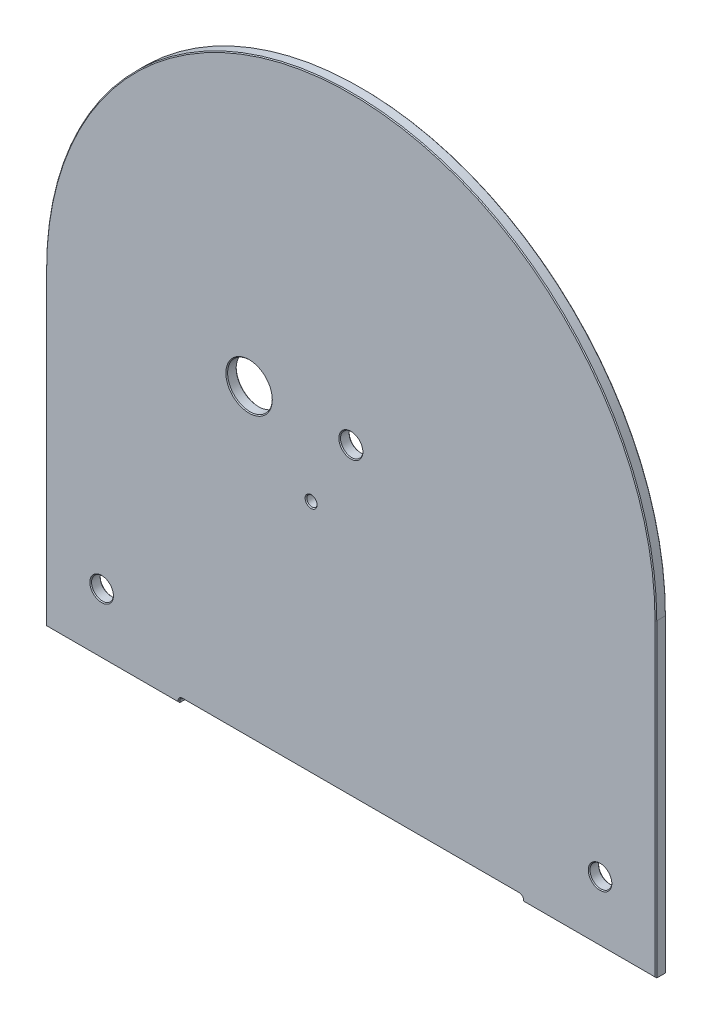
ISO-10303-21;
HEADER;
FILE_DESCRIPTION(('STEP AP214'),'2;1');
FILE_NAME('part.step','',(''),(''),'','','');
FILE_SCHEMA(('AUTOMOTIVE_DESIGN { 1 0 10303 214 1 1 1 1 }'));
ENDSEC;
DATA;
#1=APPLICATION_CONTEXT('core data for automotive mechanical design processes');
#2=APPLICATION_PROTOCOL_DEFINITION('international standard','automotive_design',2000,#1);
#3=PRODUCT_CONTEXT('',#1,'mechanical');
#4=PRODUCT('Part','Part','',(#3));
#5=PRODUCT_RELATED_PRODUCT_CATEGORY('part','',(#4));
#6=PRODUCT_DEFINITION_FORMATION('','',#4);
#7=PRODUCT_DEFINITION_CONTEXT('part definition',#1,'design');
#8=PRODUCT_DEFINITION('design','',#6,#7);
#9=PRODUCT_DEFINITION_SHAPE('','',#8);
#10=(LENGTH_UNIT() NAMED_UNIT(*) SI_UNIT(.MILLI.,.METRE.));
#11=(NAMED_UNIT(*) PLANE_ANGLE_UNIT() SI_UNIT($,.RADIAN.));
#12=(NAMED_UNIT(*) SI_UNIT($,.STERADIAN.) SOLID_ANGLE_UNIT());
#13=UNCERTAINTY_MEASURE_WITH_UNIT(LENGTH_MEASURE(1.E-05),#10,'distance_accuracy_value','');
#14=(GEOMETRIC_REPRESENTATION_CONTEXT(3) GLOBAL_UNCERTAINTY_ASSIGNED_CONTEXT((#13)) GLOBAL_UNIT_ASSIGNED_CONTEXT((#10,
#11,#12)) REPRESENTATION_CONTEXT('',''));
#15=CARTESIAN_POINT('',(0.,0.,0.));
#16=DIRECTION('',(0.,0.,1.));
#17=DIRECTION('',(1.,0.,0.));
#18=AXIS2_PLACEMENT_3D('',#15,#16,#17);
#19=CARTESIAN_POINT('',(-97.9999999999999,-177.73,6.));
#20=DIRECTION('',(0.,0.,1.));
#21=DIRECTION('',(1.,0.,0.));
#22=AXIS2_PLACEMENT_3D('',#19,#20,#21);
#23=PLANE('',#22);
#24=CARTESIAN_POINT('',(-59.2,1.27,6.));
#25=DIRECTION('',(0.,0.,1.));
#26=DIRECTION('',(1.,0.,0.));
#27=AXIS2_PLACEMENT_3D('',#24,#25,#26);
#28=CIRCLE('',#27,13.4999999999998);
#29=CARTESIAN_POINT('',(-45.7000000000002,1.27,6.));
#30=VERTEX_POINT('',#29);
#31=EDGE_CURVE('E11',#30,#30,#28,.F.);
#32=ORIENTED_EDGE('',*,*,#31,.T.);
#33=EDGE_LOOP('',(#32));
#34=FACE_BOUND('',#33,.T.);
#35=CARTESIAN_POINT('',(0.,1.27,6.));
#36=DIRECTION('',(0.,0.,1.));
#37=DIRECTION('',(1.,0.,0.));
#38=AXIS2_PLACEMENT_3D('',#35,#36,#37);
#39=CIRCLE('',#38,7.00000000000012);
#40=CARTESIAN_POINT('',(7.00000000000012,1.27,6.));
#41=VERTEX_POINT('',#40);
#42=EDGE_CURVE('E39',#41,#41,#39,.F.);
#43=ORIENTED_EDGE('',*,*,#42,.T.);
#44=EDGE_LOOP('',(#43));
#45=FACE_BOUND('',#44,.T.);
#46=CARTESIAN_POINT('',(-145.,-143.73,6.));
#47=DIRECTION('',(0.,0.,1.));
#48=DIRECTION('',(1.,0.,0.));
#49=AXIS2_PLACEMENT_3D('',#46,#47,#48);
#50=CIRCLE('',#49,6.84999999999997);
#51=CARTESIAN_POINT('',(-138.15,-143.73,6.));
#52=VERTEX_POINT('',#51);
#53=EDGE_CURVE('E305',#52,#52,#50,.F.);
#54=ORIENTED_EDGE('',*,*,#53,.T.);
#55=EDGE_LOOP('',(#54));
#56=FACE_BOUND('',#55,.T.);
#57=DIRECTION('',(1.,0.,0.));
#58=VECTOR('',#57,1.);
#59=CARTESIAN_POINT('',(-100.,-178.23,6.));
#60=LINE('',#59,#58);
#61=CARTESIAN_POINT('',(-177.,-178.23,6.));
#62=VERTEX_POINT('',#61);
#63=CARTESIAN_POINT('',(-100.5,-178.23,6.));
#64=VERTEX_POINT('',#63);
#65=EDGE_CURVE('E47',#62,#64,#60,.T.);
#66=ORIENTED_EDGE('',*,*,#65,.T.);
#67=DIRECTION('',(0.,1.,0.));
#68=VECTOR('',#67,1.);
#69=CARTESIAN_POINT('',(-100.5,-177.73,6.));
#70=LINE('',#69,#68);
#71=CARTESIAN_POINT('',(-100.5,-177.73,6.));
#72=VERTEX_POINT('',#71);
#73=EDGE_CURVE('E303',#64,#72,#70,.T.);
#74=ORIENTED_EDGE('',*,*,#73,.T.);
#75=CARTESIAN_POINT('',(-97.9999999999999,-177.73,6.));
#76=DIRECTION('',(0.,0.,1.));
#77=DIRECTION('',(1.,0.,0.));
#78=AXIS2_PLACEMENT_3D('',#75,#76,#77);
#79=CIRCLE('',#78,2.5);
#80=CARTESIAN_POINT('',(-97.9999999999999,-175.23,6.));
#81=VERTEX_POINT('',#80);
#82=EDGE_CURVE('E287',#72,#81,#79,.F.);
#83=ORIENTED_EDGE('',*,*,#82,.T.);
#84=DIRECTION('',(1.,0.,0.));
#85=VECTOR('',#84,1.);
#86=CARTESIAN_POINT('',(97.9999999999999,-175.23,6.));
#87=LINE('',#86,#85);
#88=CARTESIAN_POINT('',(97.9999999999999,-175.23,6.));
#89=VERTEX_POINT('',#88);
#90=EDGE_CURVE('E289',#81,#89,#87,.T.);
#91=ORIENTED_EDGE('',*,*,#90,.T.);
#92=CARTESIAN_POINT('',(97.9999999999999,-177.73,6.));
#93=DIRECTION('',(0.,0.,1.));
#94=DIRECTION('',(1.,0.,0.));
#95=AXIS2_PLACEMENT_3D('',#92,#93,#94);
#96=CIRCLE('',#95,2.50000000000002);
#97=CARTESIAN_POINT('',(100.5,-177.73,6.));
#98=VERTEX_POINT('',#97);
#99=EDGE_CURVE('E291',#89,#98,#96,.F.);
#100=ORIENTED_EDGE('',*,*,#99,.T.);
#101=DIRECTION('',(0.,-1.,0.));
#102=VECTOR('',#101,1.);
#103=CARTESIAN_POINT('',(100.5,-178.73,6.));
#104=LINE('',#103,#102);
#105=CARTESIAN_POINT('',(100.5,-178.23,6.));
#106=VERTEX_POINT('',#105);
#107=EDGE_CURVE('E293',#98,#106,#104,.T.);
#108=ORIENTED_EDGE('',*,*,#107,.T.);
#109=DIRECTION('',(1.,0.,0.));
#110=VECTOR('',#109,1.);
#111=CARTESIAN_POINT('',(177.5,-178.23,6.));
#112=LINE('',#111,#110);
#113=CARTESIAN_POINT('',(177.,-178.23,6.));
#114=VERTEX_POINT('',#113);
#115=EDGE_CURVE('E295',#106,#114,#112,.T.);
#116=ORIENTED_EDGE('',*,*,#115,.T.);
#117=DIRECTION('',(0.,1.,0.));
#118=VECTOR('',#117,1.);
#119=CARTESIAN_POINT('',(177.,1.27,6.));
#120=LINE('',#119,#118);
#121=CARTESIAN_POINT('',(177.,1.27,6.));
#122=VERTEX_POINT('',#121);
#123=EDGE_CURVE('E297',#114,#122,#120,.T.);
#124=ORIENTED_EDGE('',*,*,#123,.T.);
#125=CARTESIAN_POINT('',(0.,1.27,6.));
#126=DIRECTION('',(0.,0.,1.));
#127=DIRECTION('',(1.,0.,0.));
#128=AXIS2_PLACEMENT_3D('',#125,#126,#127);
#129=CIRCLE('',#128,177.);
#130=CARTESIAN_POINT('',(-177.,1.27000000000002,6.));
#131=VERTEX_POINT('',#130);
#132=EDGE_CURVE('E299',#122,#131,#129,.T.);
#133=ORIENTED_EDGE('',*,*,#132,.T.);
#134=DIRECTION('',(0.,-1.,0.));
#135=VECTOR('',#134,1.);
#136=CARTESIAN_POINT('',(-177.,-178.73,6.));
#137=LINE('',#136,#135);
#138=EDGE_CURVE('E52',#131,#62,#137,.T.);
#139=ORIENTED_EDGE('',*,*,#138,.T.);
#140=EDGE_LOOP('',(#66,#74,#83,#91,#100,#108,#116,#124,#133,#139));
#141=FACE_BOUND('',#140,.T.);
#142=CARTESIAN_POINT('',(145.,-143.73,6.));
#143=DIRECTION('',(0.,0.,1.));
#144=DIRECTION('',(1.,0.,0.));
#145=AXIS2_PLACEMENT_3D('',#142,#143,#144);
#146=CIRCLE('',#145,6.84999999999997);
#147=CARTESIAN_POINT('',(151.85,-143.73,6.));
#148=VERTEX_POINT('',#147);
#149=EDGE_CURVE('E284',#148,#148,#146,.F.);
#150=ORIENTED_EDGE('',*,*,#149,.T.);
#151=EDGE_LOOP('',(#150));
#152=FACE_BOUND('',#151,.T.);
#153=CARTESIAN_POINT('',(-23.12,-38.7288199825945,6.));
#154=DIRECTION('',(0.,0.,1.));
#155=DIRECTION('',(1.,0.,0.));
#156=AXIS2_PLACEMENT_3D('',#153,#154,#155);
#157=CIRCLE('',#156,3.5);
#158=CARTESIAN_POINT('',(-19.62,-38.7288199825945,6.));
#159=VERTEX_POINT('',#158);
#160=EDGE_CURVE('E281',#159,#159,#157,.F.);
#161=ORIENTED_EDGE('',*,*,#160,.T.);
#162=EDGE_LOOP('',(#161));
#163=FACE_BOUND('',#162,.T.);
#164=ADVANCED_FACE('F30',(#34,#45,#56,#141,#152,#163),#23,.T.);
#165=CARTESIAN_POINT('',(-97.9999999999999,-177.73,0.));
#166=DIRECTION('',(0.,0.,1.));
#167=DIRECTION('',(1.,0.,0.));
#168=AXIS2_PLACEMENT_3D('',#165,#166,#167);
#169=PLANE('',#168);
#170=CARTESIAN_POINT('',(-59.2,1.27,0.));
#171=DIRECTION('',(0.,0.,1.));
#172=DIRECTION('',(1.,0.,0.));
#173=AXIS2_PLACEMENT_3D('',#170,#171,#172);
#174=CIRCLE('',#173,13.5);
#175=CARTESIAN_POINT('',(-45.7,1.27,0.));
#176=VERTEX_POINT('',#175);
#177=EDGE_CURVE('E208',#176,#176,#174,.T.);
#178=ORIENTED_EDGE('',*,*,#177,.T.);
#179=EDGE_LOOP('',(#178));
#180=FACE_BOUND('',#179,.T.);
#181=CARTESIAN_POINT('',(0.,1.27,0.));
#182=DIRECTION('',(0.,0.,1.));
#183=DIRECTION('',(1.,0.,0.));
#184=AXIS2_PLACEMENT_3D('',#181,#182,#183);
#185=CIRCLE('',#184,6.9999999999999);
#186=CARTESIAN_POINT('',(6.9999999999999,1.27,0.));
#187=VERTEX_POINT('',#186);
#188=EDGE_CURVE('E200',#187,#187,#185,.T.);
#189=ORIENTED_EDGE('',*,*,#188,.T.);
#190=EDGE_LOOP('',(#189));
#191=FACE_BOUND('',#190,.T.);
#192=CARTESIAN_POINT('',(-145.,-143.73,0.));
#193=DIRECTION('',(0.,0.,1.));
#194=DIRECTION('',(1.,0.,0.));
#195=AXIS2_PLACEMENT_3D('',#192,#193,#194);
#196=CIRCLE('',#195,6.85000000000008);
#197=CARTESIAN_POINT('',(-138.15,-143.73,0.));
#198=VERTEX_POINT('',#197);
#199=EDGE_CURVE('E197',#198,#198,#196,.T.);
#200=ORIENTED_EDGE('',*,*,#199,.T.);
#201=EDGE_LOOP('',(#200));
#202=FACE_BOUND('',#201,.T.);
#203=CARTESIAN_POINT('',(97.9999999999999,-177.73,0.));
#204=DIRECTION('',(0.,0.,1.));
#205=DIRECTION('',(1.,0.,0.));
#206=AXIS2_PLACEMENT_3D('',#203,#204,#205);
#207=CIRCLE('',#206,2.49999999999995);
#208=CARTESIAN_POINT('',(100.5,-177.73,0.));
#209=VERTEX_POINT('',#208);
#210=CARTESIAN_POINT('',(97.9999999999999,-175.23,0.));
#211=VERTEX_POINT('',#210);
#212=EDGE_CURVE('E196',#209,#211,#207,.T.);
#213=ORIENTED_EDGE('',*,*,#212,.T.);
#214=DIRECTION('',(-1.,0.,0.));
#215=VECTOR('',#214,1.);
#216=CARTESIAN_POINT('',(-97.9999999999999,-175.23,0.));
#217=LINE('',#216,#215);
#218=CARTESIAN_POINT('',(-97.9999999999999,-175.23,0.));
#219=VERTEX_POINT('',#218);
#220=EDGE_CURVE('E174',#211,#219,#217,.T.);
#221=ORIENTED_EDGE('',*,*,#220,.T.);
#222=CARTESIAN_POINT('',(-97.9999999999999,-177.73,0.));
#223=DIRECTION('',(0.,0.,1.));
#224=DIRECTION('',(1.,0.,0.));
#225=AXIS2_PLACEMENT_3D('',#222,#223,#224);
#226=CIRCLE('',#225,2.49999999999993);
#227=CARTESIAN_POINT('',(-100.5,-177.73,0.));
#228=VERTEX_POINT('',#227);
#229=EDGE_CURVE('E184',#219,#228,#226,.T.);
#230=ORIENTED_EDGE('',*,*,#229,.T.);
#231=DIRECTION('',(0.,-1.,0.));
#232=VECTOR('',#231,1.);
#233=CARTESIAN_POINT('',(-100.5,-177.73,0.));
#234=LINE('',#233,#232);
#235=CARTESIAN_POINT('',(-100.5,-178.23,0.));
#236=VERTEX_POINT('',#235);
#237=EDGE_CURVE('E190',#228,#236,#234,.T.);
#238=ORIENTED_EDGE('',*,*,#237,.T.);
#239=DIRECTION('',(-1.,0.,0.));
#240=VECTOR('',#239,1.);
#241=CARTESIAN_POINT('',(-97.9999999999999,-178.23,0.));
#242=LINE('',#241,#240);
#243=CARTESIAN_POINT('',(-177.,-178.23,0.));
#244=VERTEX_POINT('',#243);
#245=EDGE_CURVE('E404',#236,#244,#242,.T.);
#246=ORIENTED_EDGE('',*,*,#245,.T.);
#247=DIRECTION('',(0.,1.,0.));
#248=VECTOR('',#247,1.);
#249=CARTESIAN_POINT('',(-177.,-177.73,0.));
#250=LINE('',#249,#248);
#251=CARTESIAN_POINT('',(-177.,1.27000000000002,0.));
#252=VERTEX_POINT('',#251);
#253=EDGE_CURVE('E406',#244,#252,#250,.T.);
#254=ORIENTED_EDGE('',*,*,#253,.T.);
#255=CARTESIAN_POINT('',(0.,1.27,0.));
#256=DIRECTION('',(0.,0.,1.));
#257=DIRECTION('',(1.,0.,0.));
#258=AXIS2_PLACEMENT_3D('',#255,#256,#257);
#259=CIRCLE('',#258,177.);
#260=CARTESIAN_POINT('',(177.,1.27,0.));
#261=VERTEX_POINT('',#260);
#262=EDGE_CURVE('E408',#252,#261,#259,.F.);
#263=ORIENTED_EDGE('',*,*,#262,.T.);
#264=DIRECTION('',(0.,-1.,0.));
#265=VECTOR('',#264,1.);
#266=CARTESIAN_POINT('',(177.,-177.73,0.));
#267=LINE('',#266,#265);
#268=CARTESIAN_POINT('',(177.,-178.23,0.));
#269=VERTEX_POINT('',#268);
#270=EDGE_CURVE('E410',#261,#269,#267,.T.);
#271=ORIENTED_EDGE('',*,*,#270,.T.);
#272=DIRECTION('',(-1.,0.,0.));
#273=VECTOR('',#272,1.);
#274=CARTESIAN_POINT('',(-97.9999999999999,-178.23,0.));
#275=LINE('',#274,#273);
#276=CARTESIAN_POINT('',(100.5,-178.23,0.));
#277=VERTEX_POINT('',#276);
#278=EDGE_CURVE('E412',#269,#277,#275,.T.);
#279=ORIENTED_EDGE('',*,*,#278,.T.);
#280=DIRECTION('',(0.,1.,0.));
#281=VECTOR('',#280,1.);
#282=CARTESIAN_POINT('',(100.5,-177.729999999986,0.));
#283=LINE('',#282,#281);
#284=EDGE_CURVE('E202',#277,#209,#283,.T.);
#285=ORIENTED_EDGE('',*,*,#284,.T.);
#286=EDGE_LOOP('',(#213,#221,#230,#238,#246,#254,#263,#271,#279,#285));
#287=FACE_BOUND('',#286,.T.);
#288=CARTESIAN_POINT('',(145.,-143.73,0.));
#289=DIRECTION('',(0.,0.,1.));
#290=DIRECTION('',(1.,0.,0.));
#291=AXIS2_PLACEMENT_3D('',#288,#289,#290);
#292=CIRCLE('',#291,6.85000000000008);
#293=CARTESIAN_POINT('',(151.85,-143.73,0.));
#294=VERTEX_POINT('',#293);
#295=EDGE_CURVE('E191',#294,#294,#292,.T.);
#296=ORIENTED_EDGE('',*,*,#295,.T.);
#297=EDGE_LOOP('',(#296));
#298=FACE_BOUND('',#297,.T.);
#299=CARTESIAN_POINT('',(-23.12,-38.7288199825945,0.));
#300=DIRECTION('',(0.,0.,1.));
#301=DIRECTION('',(1.,0.,0.));
#302=AXIS2_PLACEMENT_3D('',#299,#300,#301);
#303=CIRCLE('',#302,3.50000000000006);
#304=CARTESIAN_POINT('',(-19.6199999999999,-38.7288199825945,0.));
#305=VERTEX_POINT('',#304);
#306=EDGE_CURVE('E398',#305,#305,#303,.T.);
#307=ORIENTED_EDGE('',*,*,#306,.T.);
#308=EDGE_LOOP('',(#307));
#309=FACE_BOUND('',#308,.T.);
#310=ADVANCED_FACE('F193',(#180,#191,#202,#287,#298,#309),#169,.F.);
#311=CARTESIAN_POINT('',(-97.9999999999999,-177.73,6.));
#312=DIRECTION('',(0.,0.,-1.));
#313=DIRECTION('',(-1.,0.,0.));
#314=AXIS2_PLACEMENT_3D('',#311,#312,#313);
#315=CYLINDRICAL_SURFACE('',#314,1.99999999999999);
#316=DIRECTION('',(0.,0.,-1.));
#317=VECTOR('',#316,1.);
#318=CARTESIAN_POINT('',(-99.9999999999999,-177.73,6.));
#319=LINE('',#318,#317);
#320=CARTESIAN_POINT('',(-99.9999999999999,-177.73,5.49999999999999));
#321=VERTEX_POINT('',#320);
#322=CARTESIAN_POINT('',(-99.9999999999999,-177.73,0.499999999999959));
#323=VERTEX_POINT('',#322);
#324=EDGE_CURVE('E332',#321,#323,#319,.T.);
#325=ORIENTED_EDGE('',*,*,#324,.T.);
#326=CARTESIAN_POINT('',(-97.9999999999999,-177.73,0.499999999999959));
#327=DIRECTION('',(0.,0.,1.));
#328=DIRECTION('',(1.,0.,0.));
#329=AXIS2_PLACEMENT_3D('',#326,#327,#328);
#330=CIRCLE('',#329,1.99999999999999);
#331=CARTESIAN_POINT('',(-97.9999999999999,-175.73,0.499999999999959));
#332=VERTEX_POINT('',#331);
#333=EDGE_CURVE('E267',#323,#332,#330,.F.);
#334=ORIENTED_EDGE('',*,*,#333,.T.);
#335=DIRECTION('',(0.,0.,-1.));
#336=VECTOR('',#335,1.);
#337=CARTESIAN_POINT('',(-97.9999999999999,-175.73,6.));
#338=LINE('',#337,#336);
#339=CARTESIAN_POINT('',(-97.9999999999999,-175.73,5.49999999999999));
#340=VERTEX_POINT('',#339);
#341=EDGE_CURVE('E395',#340,#332,#338,.T.);
#342=ORIENTED_EDGE('',*,*,#341,.F.);
#343=CARTESIAN_POINT('',(-97.9999999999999,-177.73,5.49999999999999));
#344=DIRECTION('',(0.,0.,1.));
#345=DIRECTION('',(1.,0.,0.));
#346=AXIS2_PLACEMENT_3D('',#343,#344,#345);
#347=CIRCLE('',#346,1.99999999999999);
#348=EDGE_CURVE('E265',#340,#321,#347,.T.);
#349=ORIENTED_EDGE('',*,*,#348,.T.);
#350=EDGE_LOOP('',(#325,#334,#342,#349));
#351=FACE_BOUND('',#350,.T.);
#352=ADVANCED_FACE('F442',(#351),#315,.F.);
#353=CARTESIAN_POINT('',(-97.9999999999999,-175.73,6.));
#354=DIRECTION('',(0.,1.,0.));
#355=DIRECTION('',(0.,0.,1.));
#356=AXIS2_PLACEMENT_3D('',#353,#354,#355);
#357=PLANE('',#356);
#358=ORIENTED_EDGE('',*,*,#341,.T.);
#359=DIRECTION('',(1.,0.,0.));
#360=VECTOR('',#359,1.);
#361=CARTESIAN_POINT('',(-97.9999999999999,-175.73,0.499999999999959));
#362=LINE('',#361,#360);
#363=CARTESIAN_POINT('',(97.9999999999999,-175.73,0.499999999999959));
#364=VERTEX_POINT('',#363);
#365=EDGE_CURVE('E177',#332,#364,#362,.T.);
#366=ORIENTED_EDGE('',*,*,#365,.T.);
#367=DIRECTION('',(0.,0.,-1.));
#368=VECTOR('',#367,1.);
#369=CARTESIAN_POINT('',(97.9999999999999,-175.73,6.));
#370=LINE('',#369,#368);
#371=CARTESIAN_POINT('',(97.9999999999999,-175.73,5.49999999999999));
#372=VERTEX_POINT('',#371);
#373=EDGE_CURVE('E387',#372,#364,#370,.T.);
#374=ORIENTED_EDGE('',*,*,#373,.F.);
#375=DIRECTION('',(-1.,0.,0.));
#376=VECTOR('',#375,1.);
#377=CARTESIAN_POINT('',(-97.9999999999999,-175.73,5.49999999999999));
#378=LINE('',#377,#376);
#379=EDGE_CURVE('E229',#372,#340,#378,.T.);
#380=ORIENTED_EDGE('',*,*,#379,.T.);
#381=EDGE_LOOP('',(#358,#366,#374,#380));
#382=FACE_BOUND('',#381,.T.);
#383=ADVANCED_FACE('F425',(#382),#357,.F.);
#384=CARTESIAN_POINT('',(97.9999999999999,-177.73,6.));
#385=DIRECTION('',(0.,0.,-1.));
#386=DIRECTION('',(-1.,0.,0.));
#387=AXIS2_PLACEMENT_3D('',#384,#385,#386);
#388=CYLINDRICAL_SURFACE('',#387,1.99999999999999);
#389=ORIENTED_EDGE('',*,*,#373,.T.);
#390=CARTESIAN_POINT('',(97.9999999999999,-177.73,0.499999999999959));
#391=DIRECTION('',(0.,0.,1.));
#392=DIRECTION('',(1.,0.,0.));
#393=AXIS2_PLACEMENT_3D('',#390,#391,#392);
#394=CIRCLE('',#393,1.99999999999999);
#395=CARTESIAN_POINT('',(99.9999999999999,-177.73,0.499999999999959));
#396=VERTEX_POINT('',#395);
#397=EDGE_CURVE('E234',#364,#396,#394,.F.);
#398=ORIENTED_EDGE('',*,*,#397,.T.);
#399=DIRECTION('',(0.,0.,-1.));
#400=VECTOR('',#399,1.);
#401=CARTESIAN_POINT('',(99.9999999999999,-177.73,6.));
#402=LINE('',#401,#400);
#403=CARTESIAN_POINT('',(99.9999999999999,-177.73,5.49999999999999));
#404=VERTEX_POINT('',#403);
#405=EDGE_CURVE('E385',#404,#396,#402,.T.);
#406=ORIENTED_EDGE('',*,*,#405,.F.);
#407=CARTESIAN_POINT('',(97.9999999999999,-177.73,5.49999999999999));
#408=DIRECTION('',(0.,0.,1.));
#409=DIRECTION('',(1.,0.,0.));
#410=AXIS2_PLACEMENT_3D('',#407,#408,#409);
#411=CIRCLE('',#410,1.99999999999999);
#412=EDGE_CURVE('E232',#404,#372,#411,.T.);
#413=ORIENTED_EDGE('',*,*,#412,.T.);
#414=EDGE_LOOP('',(#389,#398,#406,#413));
#415=FACE_BOUND('',#414,.T.);
#416=ADVANCED_FACE('F428',(#415),#388,.F.);
#417=CARTESIAN_POINT('',(100.,-178.73,6.));
#418=DIRECTION('',(1.,0.,0.));
#419=DIRECTION('',(0.,1.,0.));
#420=AXIS2_PLACEMENT_3D('',#417,#418,#419);
#421=PLANE('',#420);
#422=ORIENTED_EDGE('',*,*,#405,.T.);
#423=DIRECTION('',(0.,-1.,0.));
#424=VECTOR('',#423,1.);
#425=CARTESIAN_POINT('',(100.,-178.73,0.499999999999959));
#426=LINE('',#425,#424);
#427=CARTESIAN_POINT('',(100.,-178.73,0.499999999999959));
#428=VERTEX_POINT('',#427);
#429=EDGE_CURVE('E238',#396,#428,#426,.T.);
#430=ORIENTED_EDGE('',*,*,#429,.T.);
#431=DIRECTION('',(0.,0.,-1.));
#432=VECTOR('',#431,1.);
#433=CARTESIAN_POINT('',(100.,-178.73,6.));
#434=LINE('',#433,#432);
#435=CARTESIAN_POINT('',(100.,-178.73,5.49999999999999));
#436=VERTEX_POINT('',#435);
#437=EDGE_CURVE('E376',#436,#428,#434,.T.);
#438=ORIENTED_EDGE('',*,*,#437,.F.);
#439=DIRECTION('',(0.,1.,0.));
#440=VECTOR('',#439,1.);
#441=CARTESIAN_POINT('',(99.9999999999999,-177.73,5.49999999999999));
#442=LINE('',#441,#440);
#443=EDGE_CURVE('E236',#436,#404,#442,.T.);
#444=ORIENTED_EDGE('',*,*,#443,.T.);
#445=EDGE_LOOP('',(#422,#430,#438,#444));
#446=FACE_BOUND('',#445,.T.);
#447=ADVANCED_FACE('F382',(#446),#421,.F.);
#448=CARTESIAN_POINT('',(177.5,-178.73,6.));
#449=DIRECTION('',(0.,1.,0.));
#450=DIRECTION('',(-1.,0.,0.));
#451=AXIS2_PLACEMENT_3D('',#448,#449,#450);
#452=PLANE('',#451);
#453=ORIENTED_EDGE('',*,*,#437,.T.);
#454=DIRECTION('',(1.,0.,0.));
#455=VECTOR('',#454,1.);
#456=CARTESIAN_POINT('',(177.5,-178.73,0.499999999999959));
#457=LINE('',#456,#455);
#458=CARTESIAN_POINT('',(177.5,-178.73,0.499999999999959));
#459=VERTEX_POINT('',#458);
#460=EDGE_CURVE('E242',#428,#459,#457,.T.);
#461=ORIENTED_EDGE('',*,*,#460,.T.);
#462=DIRECTION('',(0.,0.,-1.));
#463=VECTOR('',#462,1.);
#464=CARTESIAN_POINT('',(177.5,-178.73,6.));
#465=LINE('',#464,#463);
#466=CARTESIAN_POINT('',(177.5,-178.73,5.49999999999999));
#467=VERTEX_POINT('',#466);
#468=EDGE_CURVE('E379',#467,#459,#465,.T.);
#469=ORIENTED_EDGE('',*,*,#468,.F.);
#470=DIRECTION('',(-1.,0.,0.));
#471=VECTOR('',#470,1.);
#472=CARTESIAN_POINT('',(100.,-178.73,5.49999999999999));
#473=LINE('',#472,#471);
#474=EDGE_CURVE('E240',#467,#436,#473,.T.);
#475=ORIENTED_EDGE('',*,*,#474,.T.);
#476=EDGE_LOOP('',(#453,#461,#469,#475));
#477=FACE_BOUND('',#476,.T.);
#478=ADVANCED_FACE('F375',(#477),#452,.F.);
#479=CARTESIAN_POINT('',(177.5,1.27,6.));
#480=DIRECTION('',(-1.,0.,0.));
#481=DIRECTION('',(0.,0.,1.));
#482=AXIS2_PLACEMENT_3D('',#479,#480,#481);
#483=PLANE('',#482);
#484=ORIENTED_EDGE('',*,*,#468,.T.);
#485=DIRECTION('',(0.,1.,0.));
#486=VECTOR('',#485,1.);
#487=CARTESIAN_POINT('',(177.5,1.27,0.499999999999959));
#488=LINE('',#487,#486);
#489=CARTESIAN_POINT('',(177.5,1.27,0.499999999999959));
#490=VERTEX_POINT('',#489);
#491=EDGE_CURVE('E246',#459,#490,#488,.T.);
#492=ORIENTED_EDGE('',*,*,#491,.T.);
#493=DIRECTION('',(0.,0.,-1.));
#494=VECTOR('',#493,1.);
#495=CARTESIAN_POINT('',(177.5,1.27,6.));
#496=LINE('',#495,#494);
#497=CARTESIAN_POINT('',(177.5,1.27,5.49999999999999));
#498=VERTEX_POINT('',#497);
#499=EDGE_CURVE('E389',#498,#490,#496,.T.);
#500=ORIENTED_EDGE('',*,*,#499,.F.);
#501=DIRECTION('',(0.,-1.,0.));
#502=VECTOR('',#501,1.);
#503=CARTESIAN_POINT('',(177.5,-178.73,5.49999999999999));
#504=LINE('',#503,#502);
#505=EDGE_CURVE('E244',#498,#467,#504,.T.);
#506=ORIENTED_EDGE('',*,*,#505,.T.);
#507=EDGE_LOOP('',(#484,#492,#500,#506));
#508=FACE_BOUND('',#507,.T.);
#509=ADVANCED_FACE('F475',(#508),#483,.F.);
#510=CARTESIAN_POINT('',(0.,1.27,6.));
#511=DIRECTION('',(0.,0.,-1.));
#512=DIRECTION('',(-1.,0.,0.));
#513=AXIS2_PLACEMENT_3D('',#510,#511,#512);
#514=CYLINDRICAL_SURFACE('',#513,177.5);
#515=ORIENTED_EDGE('',*,*,#499,.T.);
#516=CARTESIAN_POINT('',(0.,1.27,0.499999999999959));
#517=DIRECTION('',(0.,0.,1.));
#518=DIRECTION('',(1.,0.,0.));
#519=AXIS2_PLACEMENT_3D('',#516,#517,#518);
#520=CIRCLE('',#519,177.5);
#521=CARTESIAN_POINT('',(-177.5,1.27000000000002,0.499999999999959));
#522=VERTEX_POINT('',#521);
#523=EDGE_CURVE('E250',#490,#522,#520,.T.);
#524=ORIENTED_EDGE('',*,*,#523,.T.);
#525=DIRECTION('',(0.,0.,-1.));
#526=VECTOR('',#525,1.);
#527=CARTESIAN_POINT('',(-177.5,1.27000000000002,6.));
#528=LINE('',#527,#526);
#529=CARTESIAN_POINT('',(-177.5,1.27000000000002,5.49999999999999));
#530=VERTEX_POINT('',#529);
#531=EDGE_CURVE('E479',#530,#522,#528,.T.);
#532=ORIENTED_EDGE('',*,*,#531,.F.);
#533=CARTESIAN_POINT('',(0.,1.27,5.49999999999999));
#534=DIRECTION('',(0.,0.,1.));
#535=DIRECTION('',(1.,0.,0.));
#536=AXIS2_PLACEMENT_3D('',#533,#534,#535);
#537=CIRCLE('',#536,177.5);
#538=EDGE_CURVE('E248',#530,#498,#537,.F.);
#539=ORIENTED_EDGE('',*,*,#538,.T.);
#540=EDGE_LOOP('',(#515,#524,#532,#539));
#541=FACE_BOUND('',#540,.T.);
#542=ADVANCED_FACE('F538',(#541),#514,.T.);
#543=CARTESIAN_POINT('',(-177.5,1.27,6.));
#544=DIRECTION('',(1.,0.,0.));
#545=DIRECTION('',(0.,0.,-1.));
#546=AXIS2_PLACEMENT_3D('',#543,#544,#545);
#547=PLANE('',#546);
#548=ORIENTED_EDGE('',*,*,#531,.T.);
#549=DIRECTION('',(0.,-1.,0.));
#550=VECTOR('',#549,1.);
#551=CARTESIAN_POINT('',(-177.5,1.27,0.499999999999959));
#552=LINE('',#551,#550);
#553=CARTESIAN_POINT('',(-177.5,-178.73,0.499999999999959));
#554=VERTEX_POINT('',#553);
#555=EDGE_CURVE('E254',#522,#554,#552,.T.);
#556=ORIENTED_EDGE('',*,*,#555,.T.);
#557=DIRECTION('',(0.,0.,-1.));
#558=VECTOR('',#557,1.);
#559=CARTESIAN_POINT('',(-177.5,-178.73,6.));
#560=LINE('',#559,#558);
#561=CARTESIAN_POINT('',(-177.5,-178.73,5.49999999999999));
#562=VERTEX_POINT('',#561);
#563=EDGE_CURVE('E481',#562,#554,#560,.T.);
#564=ORIENTED_EDGE('',*,*,#563,.F.);
#565=DIRECTION('',(0.,1.,0.));
#566=VECTOR('',#565,1.);
#567=CARTESIAN_POINT('',(-177.5,1.27000000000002,5.49999999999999));
#568=LINE('',#567,#566);
#569=EDGE_CURVE('E252',#562,#530,#568,.T.);
#570=ORIENTED_EDGE('',*,*,#569,.T.);
#571=EDGE_LOOP('',(#548,#556,#564,#570));
#572=FACE_BOUND('',#571,.T.);
#573=ADVANCED_FACE('F495',(#572),#547,.F.);
#574=CARTESIAN_POINT('',(-100.,-178.73,6.));
#575=DIRECTION('',(0.,1.,0.));
#576=DIRECTION('',(-1.,0.,0.));
#577=AXIS2_PLACEMENT_3D('',#574,#575,#576);
#578=PLANE('',#577);
#579=ORIENTED_EDGE('',*,*,#563,.T.);
#580=DIRECTION('',(1.,0.,0.));
#581=VECTOR('',#580,1.);
#582=CARTESIAN_POINT('',(-100.,-178.73,0.499999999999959));
#583=LINE('',#582,#581);
#584=CARTESIAN_POINT('',(-100.,-178.73,0.499999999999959));
#585=VERTEX_POINT('',#584);
#586=EDGE_CURVE('E258',#554,#585,#583,.T.);
#587=ORIENTED_EDGE('',*,*,#586,.T.);
#588=DIRECTION('',(0.,0.,-1.));
#589=VECTOR('',#588,1.);
#590=CARTESIAN_POINT('',(-100.,-178.73,6.));
#591=LINE('',#590,#589);
#592=CARTESIAN_POINT('',(-100.,-178.73,5.49999999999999));
#593=VERTEX_POINT('',#592);
#594=EDGE_CURVE('E446',#593,#585,#591,.T.);
#595=ORIENTED_EDGE('',*,*,#594,.F.);
#596=DIRECTION('',(-1.,0.,0.));
#597=VECTOR('',#596,1.);
#598=CARTESIAN_POINT('',(-177.5,-178.73,5.49999999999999));
#599=LINE('',#598,#597);
#600=EDGE_CURVE('E256',#593,#562,#599,.T.);
#601=ORIENTED_EDGE('',*,*,#600,.T.);
#602=EDGE_LOOP('',(#579,#587,#595,#601));
#603=FACE_BOUND('',#602,.T.);
#604=ADVANCED_FACE('F490',(#603),#578,.F.);
#605=CARTESIAN_POINT('',(-100.,-178.73,6.));
#606=DIRECTION('',(-1.,0.,0.));
#607=DIRECTION('',(0.,-1.,0.));
#608=AXIS2_PLACEMENT_3D('',#605,#606,#607);
#609=PLANE('',#608);
#610=ORIENTED_EDGE('',*,*,#594,.T.);
#611=DIRECTION('',(0.,1.,0.));
#612=VECTOR('',#611,1.);
#613=CARTESIAN_POINT('',(-100.,-178.73,0.499999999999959));
#614=LINE('',#613,#612);
#615=EDGE_CURVE('E263',#585,#323,#614,.T.);
#616=ORIENTED_EDGE('',*,*,#615,.T.);
#617=ORIENTED_EDGE('',*,*,#324,.F.);
#618=DIRECTION('',(0.,-1.,0.));
#619=VECTOR('',#618,1.);
#620=CARTESIAN_POINT('',(-100.,-178.73,5.49999999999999));
#621=LINE('',#620,#619);
#622=EDGE_CURVE('E260',#321,#593,#621,.T.);
#623=ORIENTED_EDGE('',*,*,#622,.T.);
#624=EDGE_LOOP('',(#610,#616,#617,#623));
#625=FACE_BOUND('',#624,.T.);
#626=ADVANCED_FACE('F488',(#625),#609,.F.);
#627=CARTESIAN_POINT('',(-145.,-143.73,6.));
#628=DIRECTION('',(0.,0.,-1.));
#629=DIRECTION('',(-1.,0.,0.));
#630=AXIS2_PLACEMENT_3D('',#627,#628,#629);
#631=CYLINDRICAL_SURFACE('',#630,6.34999999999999);
#632=CARTESIAN_POINT('',(-145.,-143.73,0.500000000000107));
#633=DIRECTION('',(0.,0.,1.));
#634=DIRECTION('',(1.,0.,0.));
#635=AXIS2_PLACEMENT_3D('',#632,#633,#634);
#636=CIRCLE('',#635,6.34999999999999);
#637=CARTESIAN_POINT('',(-138.65,-143.73,0.500000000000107));
#638=VERTEX_POINT('',#637);
#639=EDGE_CURVE('E226',#638,#638,#636,.F.);
#640=ORIENTED_EDGE('',*,*,#639,.T.);
#641=EDGE_LOOP('',(#640));
#642=FACE_BOUND('',#641,.T.);
#643=CARTESIAN_POINT('',(-145.,-143.73,5.50000000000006));
#644=DIRECTION('',(0.,0.,1.));
#645=DIRECTION('',(1.,0.,0.));
#646=AXIS2_PLACEMENT_3D('',#643,#644,#645);
#647=CIRCLE('',#646,6.34999999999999);
#648=CARTESIAN_POINT('',(-138.65,-143.73,5.50000000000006));
#649=VERTEX_POINT('',#648);
#650=EDGE_CURVE('E223',#649,#649,#647,.T.);
#651=ORIENTED_EDGE('',*,*,#650,.T.);
#652=EDGE_LOOP('',(#651));
#653=FACE_BOUND('',#652,.T.);
#654=ADVANCED_FACE('F529',(#642,#653),#631,.F.);
#655=CARTESIAN_POINT('',(145.,-143.73,6.));
#656=DIRECTION('',(0.,0.,-1.));
#657=DIRECTION('',(-1.,0.,0.));
#658=AXIS2_PLACEMENT_3D('',#655,#656,#657);
#659=CYLINDRICAL_SURFACE('',#658,6.34999999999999);
#660=CARTESIAN_POINT('',(145.,-143.73,0.500000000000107));
#661=DIRECTION('',(0.,0.,1.));
#662=DIRECTION('',(1.,0.,0.));
#663=AXIS2_PLACEMENT_3D('',#660,#661,#662);
#664=CIRCLE('',#663,6.34999999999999);
#665=CARTESIAN_POINT('',(151.35,-143.73,0.500000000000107));
#666=VERTEX_POINT('',#665);
#667=EDGE_CURVE('E272',#666,#666,#664,.F.);
#668=ORIENTED_EDGE('',*,*,#667,.T.);
#669=EDGE_LOOP('',(#668));
#670=FACE_BOUND('',#669,.T.);
#671=CARTESIAN_POINT('',(145.,-143.73,5.50000000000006));
#672=DIRECTION('',(0.,0.,1.));
#673=DIRECTION('',(1.,0.,0.));
#674=AXIS2_PLACEMENT_3D('',#671,#672,#673);
#675=CIRCLE('',#674,6.34999999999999);
#676=CARTESIAN_POINT('',(151.35,-143.73,5.50000000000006));
#677=VERTEX_POINT('',#676);
#678=EDGE_CURVE('E269',#677,#677,#675,.T.);
#679=ORIENTED_EDGE('',*,*,#678,.T.);
#680=EDGE_LOOP('',(#679));
#681=FACE_BOUND('',#680,.T.);
#682=ADVANCED_FACE('F614',(#670,#681),#659,.F.);
#683=CARTESIAN_POINT('',(0.,1.27,6.));
#684=DIRECTION('',(0.,0.,-1.));
#685=DIRECTION('',(-1.,0.,0.));
#686=AXIS2_PLACEMENT_3D('',#683,#684,#685);
#687=CYLINDRICAL_SURFACE('',#686,6.5);
#688=CARTESIAN_POINT('',(0.,1.27,0.499999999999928));
#689=DIRECTION('',(0.,0.,1.));
#690=DIRECTION('',(1.,0.,0.));
#691=AXIS2_PLACEMENT_3D('',#688,#689,#690);
#692=CIRCLE('',#691,6.5);
#693=CARTESIAN_POINT('',(6.5,1.27,0.499999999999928));
#694=VERTEX_POINT('',#693);
#695=EDGE_CURVE('E220',#694,#694,#692,.F.);
#696=ORIENTED_EDGE('',*,*,#695,.T.);
#697=EDGE_LOOP('',(#696));
#698=FACE_BOUND('',#697,.T.);
#699=CARTESIAN_POINT('',(0.,1.27,5.49999999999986));
#700=DIRECTION('',(0.,0.,1.));
#701=DIRECTION('',(1.,0.,0.));
#702=AXIS2_PLACEMENT_3D('',#699,#700,#701);
#703=CIRCLE('',#702,6.5);
#704=CARTESIAN_POINT('',(6.5,1.27,5.49999999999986));
#705=VERTEX_POINT('',#704);
#706=EDGE_CURVE('E217',#705,#705,#703,.T.);
#707=ORIENTED_EDGE('',*,*,#706,.T.);
#708=EDGE_LOOP('',(#707));
#709=FACE_BOUND('',#708,.T.);
#710=ADVANCED_FACE('F619',(#698,#709),#687,.F.);
#711=CARTESIAN_POINT('',(-23.12,-38.7288199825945,6.));
#712=DIRECTION('',(0.,0.,-1.));
#713=DIRECTION('',(-1.,0.,0.));
#714=AXIS2_PLACEMENT_3D('',#711,#712,#713);
#715=CYLINDRICAL_SURFACE('',#714,3.);
#716=CARTESIAN_POINT('',(-23.12,-38.7288199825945,0.500000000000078));
#717=DIRECTION('',(0.,0.,1.));
#718=DIRECTION('',(1.,0.,0.));
#719=AXIS2_PLACEMENT_3D('',#716,#717,#718);
#720=CIRCLE('',#719,3.);
#721=CARTESIAN_POINT('',(-20.12,-38.7288199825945,0.500000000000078));
#722=VERTEX_POINT('',#721);
#723=EDGE_CURVE('E278',#722,#722,#720,.F.);
#724=ORIENTED_EDGE('',*,*,#723,.T.);
#725=EDGE_LOOP('',(#724));
#726=FACE_BOUND('',#725,.T.);
#727=CARTESIAN_POINT('',(-23.12,-38.7288199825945,5.49999999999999));
#728=DIRECTION('',(0.,0.,1.));
#729=DIRECTION('',(1.,0.,0.));
#730=AXIS2_PLACEMENT_3D('',#727,#728,#729);
#731=CIRCLE('',#730,3.);
#732=CARTESIAN_POINT('',(-20.12,-38.7288199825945,5.49999999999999));
#733=VERTEX_POINT('',#732);
#734=EDGE_CURVE('E275',#733,#733,#731,.T.);
#735=ORIENTED_EDGE('',*,*,#734,.T.);
#736=EDGE_LOOP('',(#735));
#737=FACE_BOUND('',#736,.T.);
#738=ADVANCED_FACE('F628',(#726,#737),#715,.F.);
#739=CARTESIAN_POINT('',(-59.2,1.27,6.));
#740=DIRECTION('',(0.,0.,-1.));
#741=DIRECTION('',(-1.,0.,0.));
#742=AXIS2_PLACEMENT_3D('',#739,#740,#741);
#743=CYLINDRICAL_SURFACE('',#742,13.);
#744=CARTESIAN_POINT('',(-59.2,1.27,0.500000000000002));
#745=DIRECTION('',(0.,0.,1.));
#746=DIRECTION('',(1.,0.,0.));
#747=AXIS2_PLACEMENT_3D('',#744,#745,#746);
#748=CIRCLE('',#747,13.);
#749=CARTESIAN_POINT('',(-46.2,1.27,0.500000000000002));
#750=VERTEX_POINT('',#749);
#751=EDGE_CURVE('E214',#750,#750,#748,.F.);
#752=ORIENTED_EDGE('',*,*,#751,.T.);
#753=EDGE_LOOP('',(#752));
#754=FACE_BOUND('',#753,.T.);
#755=CARTESIAN_POINT('',(-59.2,1.27,5.50000000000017));
#756=DIRECTION('',(0.,0.,1.));
#757=DIRECTION('',(1.,0.,0.));
#758=AXIS2_PLACEMENT_3D('',#755,#756,#757);
#759=CIRCLE('',#758,13.);
#760=CARTESIAN_POINT('',(-46.2,1.27,5.50000000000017));
#761=VERTEX_POINT('',#760);
#762=EDGE_CURVE('E211',#761,#761,#759,.T.);
#763=ORIENTED_EDGE('',*,*,#762,.T.);
#764=EDGE_LOOP('',(#763));
#765=FACE_BOUND('',#764,.T.);
#766=ADVANCED_FACE('F557',(#754,#765),#743,.F.);
#767=CARTESIAN_POINT('',(-59.2,1.27,0.));
#768=DIRECTION('',(0.,0.,-1.));
#769=DIRECTION('',(-1.,0.,0.));
#770=AXIS2_PLACEMENT_3D('',#767,#768,#769);
#771=CONICAL_SURFACE('',#770,13.5,0.785398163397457);
#772=ORIENTED_EDGE('',*,*,#751,.F.);
#773=EDGE_LOOP('',(#772));
#774=FACE_BOUND('',#773,.T.);
#775=ORIENTED_EDGE('',*,*,#177,.F.);
#776=EDGE_LOOP('',(#775));
#777=FACE_BOUND('',#776,.T.);
#778=ADVANCED_FACE('F553',(#774,#777),#771,.F.);
#779=CARTESIAN_POINT('',(0.,1.27,0.));
#780=DIRECTION('',(0.,0.,-1.));
#781=DIRECTION('',(-1.,0.,0.));
#782=AXIS2_PLACEMENT_3D('',#779,#780,#781);
#783=CONICAL_SURFACE('',#782,6.9999999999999,0.785398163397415);
#784=ORIENTED_EDGE('',*,*,#695,.F.);
#785=EDGE_LOOP('',(#784));
#786=FACE_BOUND('',#785,.T.);
#787=ORIENTED_EDGE('',*,*,#188,.F.);
#788=EDGE_LOOP('',(#787));
#789=FACE_BOUND('',#788,.T.);
#790=ADVANCED_FACE('F556',(#786,#789),#783,.F.);
#791=CARTESIAN_POINT('',(-145.,-143.73,0.));
#792=DIRECTION('',(0.,0.,-1.));
#793=DIRECTION('',(-1.,0.,0.));
#794=AXIS2_PLACEMENT_3D('',#791,#792,#793);
#795=CONICAL_SURFACE('',#794,6.85000000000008,0.785398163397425);
#796=ORIENTED_EDGE('',*,*,#639,.F.);
#797=EDGE_LOOP('',(#796));
#798=FACE_BOUND('',#797,.T.);
#799=ORIENTED_EDGE('',*,*,#199,.F.);
#800=EDGE_LOOP('',(#799));
#801=FACE_BOUND('',#800,.T.);
#802=ADVANCED_FACE('F561',(#798,#801),#795,.F.);
#803=CARTESIAN_POINT('',(0.,1.27,0.499999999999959));
#804=DIRECTION('',(0.,0.,1.));
#805=DIRECTION('',(1.,0.,0.));
#806=AXIS2_PLACEMENT_3D('',#803,#804,#805);
#807=CONICAL_SURFACE('',#806,177.5,0.785398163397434);
#808=DIRECTION('',(0.707106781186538,0.,0.707106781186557));
#809=VECTOR('',#808,1.);
#810=CARTESIAN_POINT('',(177.,1.27,0.));
#811=LINE('',#810,#809);
#812=EDGE_CURVE('E326',#261,#490,#811,.T.);
#813=ORIENTED_EDGE('',*,*,#812,.F.);
#814=ORIENTED_EDGE('',*,*,#262,.F.);
#815=DIRECTION('',(0.707106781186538,0.,-0.707106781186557));
#816=VECTOR('',#815,1.);
#817=CARTESIAN_POINT('',(-177.5,1.27000000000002,0.499999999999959));
#818=LINE('',#817,#816);
#819=EDGE_CURVE('E329',#522,#252,#818,.T.);
#820=ORIENTED_EDGE('',*,*,#819,.F.);
#821=ORIENTED_EDGE('',*,*,#523,.F.);
#822=EDGE_LOOP('',(#813,#814,#820,#821));
#823=FACE_BOUND('',#822,.T.);
#824=ADVANCED_FACE('F465',(#823),#807,.T.);
#825=CARTESIAN_POINT('',(-177.5,1.27,0.499999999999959));
#826=DIRECTION('',(0.707106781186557,0.,0.707106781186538));
#827=DIRECTION('',(0.707106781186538,0.,-0.707106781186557));
#828=AXIS2_PLACEMENT_3D('',#825,#826,#827);
#829=PLANE('',#828);
#830=ORIENTED_EDGE('',*,*,#819,.T.);
#831=ORIENTED_EDGE('',*,*,#253,.F.);
#832=DIRECTION('',(0.577350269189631,0.5773502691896,-0.577350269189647));
#833=VECTOR('',#832,1.);
#834=CARTESIAN_POINT('',(-151.666666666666,-152.896666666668,-25.3333333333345));
#835=LINE('',#834,#833);
#836=EDGE_CURVE('E323',#554,#244,#835,.T.);
#837=ORIENTED_EDGE('',*,*,#836,.F.);
#838=ORIENTED_EDGE('',*,*,#555,.F.);
#839=EDGE_LOOP('',(#830,#831,#837,#838));
#840=FACE_BOUND('',#839,.T.);
#841=ADVANCED_FACE('F460',(#840),#829,.F.);
#842=CARTESIAN_POINT('',(177.5,1.27,0.499999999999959));
#843=DIRECTION('',(-0.707106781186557,0.,0.707106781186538));
#844=DIRECTION('',(0.707106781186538,0.,0.707106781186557));
#845=AXIS2_PLACEMENT_3D('',#842,#843,#844);
#846=PLANE('',#845);
#847=ORIENTED_EDGE('',*,*,#812,.T.);
#848=ORIENTED_EDGE('',*,*,#491,.F.);
#849=DIRECTION('',(-0.577350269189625,0.577350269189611,-0.577350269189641));
#850=VECTOR('',#849,1.);
#851=CARTESIAN_POINT('',(117.500000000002,-118.730000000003,-59.5000000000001));
#852=LINE('',#851,#850);
#853=EDGE_CURVE('E320',#269,#459,#852,.F.);
#854=ORIENTED_EDGE('',*,*,#853,.F.);
#855=ORIENTED_EDGE('',*,*,#270,.F.);
#856=EDGE_LOOP('',(#847,#848,#854,#855));
#857=FACE_BOUND('',#856,.T.);
#858=ADVANCED_FACE('F471',(#857),#846,.F.);
#859=CARTESIAN_POINT('',(-100.,-178.73,0.499999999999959));
#860=DIRECTION('',(0.,0.707106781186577,0.707106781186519));
#861=DIRECTION('',(0.,-0.707106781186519,0.707106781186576));
#862=AXIS2_PLACEMENT_3D('',#859,#860,#861);
#863=PLANE('',#862);
#864=ORIENTED_EDGE('',*,*,#836,.T.);
#865=ORIENTED_EDGE('',*,*,#245,.F.);
#866=DIRECTION('',(-0.577350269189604,0.577350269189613,-0.57735026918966));
#867=VECTOR('',#866,1.);
#868=CARTESIAN_POINT('',(-100.,-178.73,0.499999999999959));
#869=LINE('',#868,#867);
#870=EDGE_CURVE('E317',#585,#236,#869,.T.);
#871=ORIENTED_EDGE('',*,*,#870,.F.);
#872=ORIENTED_EDGE('',*,*,#586,.F.);
#873=EDGE_LOOP('',(#864,#865,#871,#872));
#874=FACE_BOUND('',#873,.T.);
#875=ADVANCED_FACE('F455',(#874),#863,.F.);
#876=CARTESIAN_POINT('',(177.5,-178.73,0.499999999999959));
#877=DIRECTION('',(0.,0.707106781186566,0.707106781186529));
#878=DIRECTION('',(0.,-0.707106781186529,0.707106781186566));
#879=AXIS2_PLACEMENT_3D('',#876,#877,#878);
#880=PLANE('',#879);
#881=ORIENTED_EDGE('',*,*,#853,.T.);
#882=ORIENTED_EDGE('',*,*,#460,.F.);
#883=DIRECTION('',(0.577350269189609,0.577350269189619,-0.577350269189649));
#884=VECTOR('',#883,1.);
#885=CARTESIAN_POINT('',(125.833333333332,-152.896666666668,-25.3333333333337));
#886=LINE('',#885,#884);
#887=EDGE_CURVE('E314',#277,#428,#886,.F.);
#888=ORIENTED_EDGE('',*,*,#887,.F.);
#889=ORIENTED_EDGE('',*,*,#278,.F.);
#890=EDGE_LOOP('',(#881,#882,#888,#889));
#891=FACE_BOUND('',#890,.T.);
#892=ADVANCED_FACE('F473',(#891),#880,.F.);
#893=CARTESIAN_POINT('',(-100.,-178.73,0.499999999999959));
#894=DIRECTION('',(-0.707106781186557,0.,0.707106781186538));
#895=DIRECTION('',(0.707106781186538,0.,0.707106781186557));
#896=AXIS2_PLACEMENT_3D('',#893,#894,#895);
#897=PLANE('',#896);
#898=ORIENTED_EDGE('',*,*,#870,.T.);
#899=ORIENTED_EDGE('',*,*,#237,.F.);
#900=DIRECTION('',(-0.707106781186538,0.,-0.707106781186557));
#901=VECTOR('',#900,1.);
#902=CARTESIAN_POINT('',(-99.9999999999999,-177.73,0.499999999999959));
#903=LINE('',#902,#901);
#904=EDGE_CURVE('E187',#323,#228,#903,.T.);
#905=ORIENTED_EDGE('',*,*,#904,.F.);
#906=ORIENTED_EDGE('',*,*,#615,.F.);
#907=EDGE_LOOP('',(#898,#899,#905,#906));
#908=FACE_BOUND('',#907,.T.);
#909=ADVANCED_FACE('F450',(#908),#897,.F.);
#910=CARTESIAN_POINT('',(100.,-178.73,0.499999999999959));
#911=DIRECTION('',(0.707106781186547,0.,0.707106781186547));
#912=DIRECTION('',(0.707106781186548,0.,-0.707106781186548));
#913=AXIS2_PLACEMENT_3D('',#910,#911,#912);
#914=PLANE('',#913);
#915=ORIENTED_EDGE('',*,*,#887,.T.);
#916=ORIENTED_EDGE('',*,*,#429,.F.);
#917=DIRECTION('',(-0.707106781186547,0.,0.707106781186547));
#918=VECTOR('',#917,1.);
#919=CARTESIAN_POINT('',(100.5,-177.73,0.));
#920=LINE('',#919,#918);
#921=EDGE_CURVE('E180',#209,#396,#920,.T.);
#922=ORIENTED_EDGE('',*,*,#921,.F.);
#923=ORIENTED_EDGE('',*,*,#284,.F.);
#924=EDGE_LOOP('',(#915,#916,#922,#923));
#925=FACE_BOUND('',#924,.T.);
#926=ADVANCED_FACE('F418',(#925),#914,.F.);
#927=CARTESIAN_POINT('',(-97.9999999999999,-177.73,0.499999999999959));
#928=DIRECTION('',(0.,0.,-1.));
#929=DIRECTION('',(-1.,0.,0.));
#930=AXIS2_PLACEMENT_3D('',#927,#928,#929);
#931=CONICAL_SURFACE('',#930,1.99999999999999,0.785398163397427);
#932=ORIENTED_EDGE('',*,*,#904,.T.);
#933=ORIENTED_EDGE('',*,*,#229,.F.);
#934=DIRECTION('',(0.,0.707106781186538,-0.707106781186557));
#935=VECTOR('',#934,1.);
#936=CARTESIAN_POINT('',(-97.9999999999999,-175.73,0.499999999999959));
#937=LINE('',#936,#935);
#938=EDGE_CURVE('E170',#332,#219,#937,.T.);
#939=ORIENTED_EDGE('',*,*,#938,.F.);
#940=ORIENTED_EDGE('',*,*,#333,.F.);
#941=EDGE_LOOP('',(#932,#933,#939,#940));
#942=FACE_BOUND('',#941,.T.);
#943=ADVANCED_FACE('F185',(#942),#931,.F.);
#944=CARTESIAN_POINT('',(97.9999999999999,-177.73,0.499999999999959));
#945=DIRECTION('',(0.,0.,-1.));
#946=DIRECTION('',(-1.,0.,0.));
#947=AXIS2_PLACEMENT_3D('',#944,#945,#946);
#948=CONICAL_SURFACE('',#947,1.99999999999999,0.785398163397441);
#949=ORIENTED_EDGE('',*,*,#921,.T.);
#950=ORIENTED_EDGE('',*,*,#397,.F.);
#951=DIRECTION('',(0.,-0.707106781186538,0.707106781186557));
#952=VECTOR('',#951,1.);
#953=CARTESIAN_POINT('',(97.9999999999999,-175.23,0.));
#954=LINE('',#953,#952);
#955=EDGE_CURVE('E181',#211,#364,#954,.T.);
#956=ORIENTED_EDGE('',*,*,#955,.F.);
#957=ORIENTED_EDGE('',*,*,#212,.F.);
#958=EDGE_LOOP('',(#949,#950,#956,#957));
#959=FACE_BOUND('',#958,.T.);
#960=ADVANCED_FACE('F421',(#959),#948,.F.);
#961=CARTESIAN_POINT('',(-97.9999999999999,-175.73,0.499999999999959));
#962=DIRECTION('',(0.,0.707106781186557,0.707106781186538));
#963=DIRECTION('',(0.,-0.707106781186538,0.707106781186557));
#964=AXIS2_PLACEMENT_3D('',#961,#962,#963);
#965=PLANE('',#964);
#966=ORIENTED_EDGE('',*,*,#938,.T.);
#967=ORIENTED_EDGE('',*,*,#220,.F.);
#968=ORIENTED_EDGE('',*,*,#955,.T.);
#969=ORIENTED_EDGE('',*,*,#365,.F.);
#970=EDGE_LOOP('',(#966,#967,#968,#969));
#971=FACE_BOUND('',#970,.T.);
#972=ADVANCED_FACE('F172',(#971),#965,.F.);
#973=CARTESIAN_POINT('',(145.,-143.73,0.));
#974=DIRECTION('',(0.,0.,-1.));
#975=DIRECTION('',(-1.,0.,0.));
#976=AXIS2_PLACEMENT_3D('',#973,#974,#975);
#977=CONICAL_SURFACE('',#976,6.85000000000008,0.785398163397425);
#978=ORIENTED_EDGE('',*,*,#667,.F.);
#979=EDGE_LOOP('',(#978));
#980=FACE_BOUND('',#979,.T.);
#981=ORIENTED_EDGE('',*,*,#295,.F.);
#982=EDGE_LOOP('',(#981));
#983=FACE_BOUND('',#982,.T.);
#984=ADVANCED_FACE('F568',(#980,#983),#977,.F.);
#985=CARTESIAN_POINT('',(-23.12,-38.7288199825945,0.));
#986=DIRECTION('',(0.,0.,-1.));
#987=DIRECTION('',(-1.,0.,0.));
#988=AXIS2_PLACEMENT_3D('',#985,#986,#987);
#989=CONICAL_SURFACE('',#988,3.50000000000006,0.785398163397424);
#990=ORIENTED_EDGE('',*,*,#723,.F.);
#991=EDGE_LOOP('',(#990));
#992=FACE_BOUND('',#991,.T.);
#993=ORIENTED_EDGE('',*,*,#306,.F.);
#994=EDGE_LOOP('',(#993));
#995=FACE_BOUND('',#994,.T.);
#996=ADVANCED_FACE('F589',(#992,#995),#989,.F.);
#997=CARTESIAN_POINT('',(-59.2,1.27,5.50000000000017));
#998=DIRECTION('',(0.,0.,1.));
#999=DIRECTION('',(1.,0.,0.));
#1000=AXIS2_PLACEMENT_3D('',#997,#998,#999);
#1001=CONICAL_SURFACE('',#1000,13.,0.785398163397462);
#1002=ORIENTED_EDGE('',*,*,#31,.F.);
#1003=EDGE_LOOP('',(#1002));
#1004=FACE_BOUND('',#1003,.T.);
#1005=ORIENTED_EDGE('',*,*,#762,.F.);
#1006=EDGE_LOOP('',(#1005));
#1007=FACE_BOUND('',#1006,.T.);
#1008=ADVANCED_FACE('F593',(#1004,#1007),#1001,.F.);
#1009=CARTESIAN_POINT('',(0.,1.27,5.49999999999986));
#1010=DIRECTION('',(0.,0.,1.));
#1011=DIRECTION('',(1.,0.,0.));
#1012=AXIS2_PLACEMENT_3D('',#1009,#1010,#1011);
#1013=CONICAL_SURFACE('',#1012,6.5,0.785398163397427);
#1014=ORIENTED_EDGE('',*,*,#42,.F.);
#1015=EDGE_LOOP('',(#1014));
#1016=FACE_BOUND('',#1015,.T.);
#1017=ORIENTED_EDGE('',*,*,#706,.F.);
#1018=EDGE_LOOP('',(#1017));
#1019=FACE_BOUND('',#1018,.T.);
#1020=ADVANCED_FACE('F597',(#1016,#1019),#1013,.F.);
#1021=CARTESIAN_POINT('',(-145.,-143.73,5.50000000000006));
#1022=DIRECTION('',(0.,0.,1.));
#1023=DIRECTION('',(1.,0.,0.));
#1024=AXIS2_PLACEMENT_3D('',#1021,#1022,#1023);
#1025=CONICAL_SURFACE('',#1024,6.34999999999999,0.785398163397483);
#1026=ORIENTED_EDGE('',*,*,#53,.F.);
#1027=EDGE_LOOP('',(#1026));
#1028=FACE_BOUND('',#1027,.T.);
#1029=ORIENTED_EDGE('',*,*,#650,.F.);
#1030=EDGE_LOOP('',(#1029));
#1031=FACE_BOUND('',#1030,.T.);
#1032=ADVANCED_FACE('F601',(#1028,#1031),#1025,.F.);
#1033=CARTESIAN_POINT('',(-97.9999999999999,-178.23,6.));
#1034=DIRECTION('',(0.,-0.707106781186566,0.707106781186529));
#1035=DIRECTION('',(0.,-0.707106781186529,-0.707106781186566));
#1036=AXIS2_PLACEMENT_3D('',#1033,#1034,#1035);
#1037=PLANE('',#1036);
#1038=DIRECTION('',(0.577350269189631,0.577350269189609,0.577350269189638));
#1039=VECTOR('',#1038,1.);
#1040=CARTESIAN_POINT('',(100.666666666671,-178.063333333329,6.16666666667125));
#1041=LINE('',#1040,#1039);
#1042=EDGE_CURVE('E354',#436,#106,#1041,.T.);
#1043=ORIENTED_EDGE('',*,*,#1042,.F.);
#1044=ORIENTED_EDGE('',*,*,#474,.F.);
#1045=DIRECTION('',(-0.577350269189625,0.577350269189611,0.577350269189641));
#1046=VECTOR('',#1045,1.);
#1047=CARTESIAN_POINT('',(85.3333333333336,-86.5633333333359,97.666666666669));
#1048=LINE('',#1047,#1046);
#1049=EDGE_CURVE('E34',#114,#467,#1048,.F.);
#1050=ORIENTED_EDGE('',*,*,#1049,.F.);
#1051=ORIENTED_EDGE('',*,*,#115,.F.);
#1052=EDGE_LOOP('',(#1043,#1044,#1050,#1051));
#1053=FACE_BOUND('',#1052,.T.);
#1054=ADVANCED_FACE('F370',(#1053),#1037,.T.);
#1055=CARTESIAN_POINT('',(177.,-177.73,6.));
#1056=DIRECTION('',(0.707106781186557,0.,0.707106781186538));
#1057=DIRECTION('',(0.707106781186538,0.,-0.707106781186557));
#1058=AXIS2_PLACEMENT_3D('',#1055,#1056,#1057);
#1059=PLANE('',#1058);
#1060=ORIENTED_EDGE('',*,*,#1049,.T.);
#1061=ORIENTED_EDGE('',*,*,#505,.F.);
#1062=DIRECTION('',(0.707106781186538,0.,-0.707106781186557));
#1063=VECTOR('',#1062,1.);
#1064=CARTESIAN_POINT('',(177.,1.27,6.));
#1065=LINE('',#1064,#1063);
#1066=EDGE_CURVE('E352',#122,#498,#1065,.T.);
#1067=ORIENTED_EDGE('',*,*,#1066,.F.);
#1068=ORIENTED_EDGE('',*,*,#123,.F.);
#1069=EDGE_LOOP('',(#1060,#1061,#1067,#1068));
#1070=FACE_BOUND('',#1069,.T.);
#1071=ADVANCED_FACE('F365',(#1070),#1059,.T.);
#1072=CARTESIAN_POINT('',(100.5,-177.729999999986,6.));
#1073=DIRECTION('',(-0.707106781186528,0.,0.707106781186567));
#1074=DIRECTION('',(0.707106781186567,0.,0.707106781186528));
#1075=AXIS2_PLACEMENT_3D('',#1072,#1073,#1074);
#1076=PLANE('',#1075);
#1077=ORIENTED_EDGE('',*,*,#1042,.T.);
#1078=ORIENTED_EDGE('',*,*,#107,.F.);
#1079=DIRECTION('',(0.707106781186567,0.,0.707106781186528));
#1080=VECTOR('',#1079,1.);
#1081=CARTESIAN_POINT('',(99.9999999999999,-177.73,5.49999999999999));
#1082=LINE('',#1081,#1080);
#1083=EDGE_CURVE('E349',#404,#98,#1082,.T.);
#1084=ORIENTED_EDGE('',*,*,#1083,.F.);
#1085=ORIENTED_EDGE('',*,*,#443,.F.);
#1086=EDGE_LOOP('',(#1077,#1078,#1084,#1085));
#1087=FACE_BOUND('',#1086,.T.);
#1088=ADVANCED_FACE('F738',(#1087),#1076,.T.);
#1089=CARTESIAN_POINT('',(0.,1.27,6.));
#1090=DIRECTION('',(0.,0.,-1.));
#1091=DIRECTION('',(-1.,0.,0.));
#1092=AXIS2_PLACEMENT_3D('',#1089,#1090,#1091);
#1093=CONICAL_SURFACE('',#1092,177.,0.785398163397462);
#1094=ORIENTED_EDGE('',*,*,#1066,.T.);
#1095=ORIENTED_EDGE('',*,*,#538,.F.);
#1096=DIRECTION('',(-0.707106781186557,0.,-0.707106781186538));
#1097=VECTOR('',#1096,1.);
#1098=CARTESIAN_POINT('',(-177.,1.27000000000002,6.));
#1099=LINE('',#1098,#1097);
#1100=EDGE_CURVE('E346',#131,#530,#1099,.T.);
#1101=ORIENTED_EDGE('',*,*,#1100,.F.);
#1102=ORIENTED_EDGE('',*,*,#132,.F.);
#1103=EDGE_LOOP('',(#1094,#1095,#1101,#1102));
#1104=FACE_BOUND('',#1103,.T.);
#1105=ADVANCED_FACE('F747',(#1104),#1093,.T.);
#1106=CARTESIAN_POINT('',(97.9999999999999,-177.73,6.));
#1107=DIRECTION('',(0.,0.,1.));
#1108=DIRECTION('',(1.,0.,0.));
#1109=AXIS2_PLACEMENT_3D('',#1106,#1107,#1108);
#1110=CONICAL_SURFACE('',#1109,2.50000000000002,0.785398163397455);
#1111=ORIENTED_EDGE('',*,*,#1083,.T.);
#1112=ORIENTED_EDGE('',*,*,#99,.F.);
#1113=DIRECTION('',(0.,0.707106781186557,0.707106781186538));
#1114=VECTOR('',#1113,1.);
#1115=CARTESIAN_POINT('',(97.9999999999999,-175.73,5.49999999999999));
#1116=LINE('',#1115,#1114);
#1117=EDGE_CURVE('E343',#372,#89,#1116,.T.);
#1118=ORIENTED_EDGE('',*,*,#1117,.F.);
#1119=ORIENTED_EDGE('',*,*,#412,.F.);
#1120=EDGE_LOOP('',(#1111,#1112,#1118,#1119));
#1121=FACE_BOUND('',#1120,.T.);
#1122=ADVANCED_FACE('F432',(#1121),#1110,.F.);
#1123=CARTESIAN_POINT('',(-177.,-177.73,6.));
#1124=DIRECTION('',(-0.707106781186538,0.,0.707106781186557));
#1125=DIRECTION('',(0.707106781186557,0.,0.707106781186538));
#1126=AXIS2_PLACEMENT_3D('',#1123,#1124,#1125);
#1127=PLANE('',#1126);
#1128=ORIENTED_EDGE('',*,*,#1100,.T.);
#1129=ORIENTED_EDGE('',*,*,#569,.F.);
#1130=DIRECTION('',(0.577350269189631,0.577350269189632,0.577350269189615));
#1131=VECTOR('',#1130,1.);
#1132=CARTESIAN_POINT('',(-176.833333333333,-178.063333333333,6.16666666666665));
#1133=LINE('',#1132,#1131);
#1134=EDGE_CURVE('E340',#62,#562,#1133,.F.);
#1135=ORIENTED_EDGE('',*,*,#1134,.F.);
#1136=ORIENTED_EDGE('',*,*,#138,.F.);
#1137=EDGE_LOOP('',(#1128,#1129,#1135,#1136));
#1138=FACE_BOUND('',#1137,.T.);
#1139=ADVANCED_FACE('F498',(#1138),#1127,.T.);
#1140=CARTESIAN_POINT('',(-97.9999999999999,-175.23,6.));
#1141=DIRECTION('',(0.,-0.707106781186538,0.707106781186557));
#1142=DIRECTION('',(0.,-0.707106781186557,-0.707106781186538));
#1143=AXIS2_PLACEMENT_3D('',#1140,#1141,#1142);
#1144=PLANE('',#1143);
#1145=ORIENTED_EDGE('',*,*,#1117,.T.);
#1146=ORIENTED_EDGE('',*,*,#90,.F.);
#1147=DIRECTION('',(0.,0.707106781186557,0.707106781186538));
#1148=VECTOR('',#1147,1.);
#1149=CARTESIAN_POINT('',(-97.9999999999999,-175.73,5.49999999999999));
#1150=LINE('',#1149,#1148);
#1151=EDGE_CURVE('E337',#340,#81,#1150,.T.);
#1152=ORIENTED_EDGE('',*,*,#1151,.F.);
#1153=ORIENTED_EDGE('',*,*,#379,.F.);
#1154=EDGE_LOOP('',(#1145,#1146,#1152,#1153));
#1155=FACE_BOUND('',#1154,.T.);
#1156=ADVANCED_FACE('F438',(#1155),#1144,.T.);
#1157=CARTESIAN_POINT('',(-97.9999999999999,-178.23,6.));
#1158=DIRECTION('',(0.,-0.707106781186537,0.707106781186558));
#1159=DIRECTION('',(0.,-0.707106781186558,-0.707106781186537));
#1160=AXIS2_PLACEMENT_3D('',#1157,#1158,#1159);
#1161=PLANE('',#1160);
#1162=ORIENTED_EDGE('',*,*,#1134,.T.);
#1163=ORIENTED_EDGE('',*,*,#600,.F.);
#1164=DIRECTION('',(-0.577350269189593,0.57735026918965,0.577350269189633));
#1165=VECTOR('',#1164,1.);
#1166=CARTESIAN_POINT('',(-99.6666666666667,-179.063333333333,5.16666666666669));
#1167=LINE('',#1166,#1165);
#1168=EDGE_CURVE('E335',#64,#593,#1167,.F.);
#1169=ORIENTED_EDGE('',*,*,#1168,.F.);
#1170=ORIENTED_EDGE('',*,*,#65,.F.);
#1171=EDGE_LOOP('',(#1162,#1163,#1169,#1170));
#1172=FACE_BOUND('',#1171,.T.);
#1173=ADVANCED_FACE('F501',(#1172),#1161,.T.);
#1174=CARTESIAN_POINT('',(-97.9999999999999,-177.73,6.));
#1175=DIRECTION('',(0.,0.,1.));
#1176=DIRECTION('',(1.,0.,0.));
#1177=AXIS2_PLACEMENT_3D('',#1174,#1175,#1176);
#1178=CONICAL_SURFACE('',#1177,2.5,0.785398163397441);
#1179=ORIENTED_EDGE('',*,*,#1151,.T.);
#1180=ORIENTED_EDGE('',*,*,#82,.F.);
#1181=DIRECTION('',(-0.707106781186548,0.,0.707106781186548));
#1182=VECTOR('',#1181,1.);
#1183=CARTESIAN_POINT('',(-99.9999999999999,-177.73,5.49999999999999));
#1184=LINE('',#1183,#1182);
#1185=EDGE_CURVE('E333',#321,#72,#1184,.T.);
#1186=ORIENTED_EDGE('',*,*,#1185,.F.);
#1187=ORIENTED_EDGE('',*,*,#348,.F.);
#1188=EDGE_LOOP('',(#1179,#1180,#1186,#1187));
#1189=FACE_BOUND('',#1188,.T.);
#1190=ADVANCED_FACE('F509',(#1189),#1178,.F.);
#1191=CARTESIAN_POINT('',(-100.5,-177.73,6.));
#1192=DIRECTION('',(0.707106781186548,0.,0.707106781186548));
#1193=DIRECTION('',(0.707106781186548,0.,-0.707106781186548));
#1194=AXIS2_PLACEMENT_3D('',#1191,#1192,#1193);
#1195=PLANE('',#1194);
#1196=ORIENTED_EDGE('',*,*,#1168,.T.);
#1197=ORIENTED_EDGE('',*,*,#622,.F.);
#1198=ORIENTED_EDGE('',*,*,#1185,.T.);
#1199=ORIENTED_EDGE('',*,*,#73,.F.);
#1200=EDGE_LOOP('',(#1196,#1197,#1198,#1199));
#1201=FACE_BOUND('',#1200,.T.);
#1202=ADVANCED_FACE('F504',(#1201),#1195,.T.);
#1203=CARTESIAN_POINT('',(145.,-143.73,5.50000000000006));
#1204=DIRECTION('',(0.,0.,1.));
#1205=DIRECTION('',(1.,0.,0.));
#1206=AXIS2_PLACEMENT_3D('',#1203,#1204,#1205);
#1207=CONICAL_SURFACE('',#1206,6.34999999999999,0.785398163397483);
#1208=ORIENTED_EDGE('',*,*,#149,.F.);
#1209=EDGE_LOOP('',(#1208));
#1210=FACE_BOUND('',#1209,.T.);
#1211=ORIENTED_EDGE('',*,*,#678,.F.);
#1212=EDGE_LOOP('',(#1211));
#1213=FACE_BOUND('',#1212,.T.);
#1214=ADVANCED_FACE('F516',(#1210,#1213),#1207,.F.);
#1215=CARTESIAN_POINT('',(-23.12,-38.7288199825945,5.49999999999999));
#1216=DIRECTION('',(0.,0.,1.));
#1217=DIRECTION('',(1.,0.,0.));
#1218=AXIS2_PLACEMENT_3D('',#1215,#1216,#1217);
#1219=CONICAL_SURFACE('',#1218,3.,0.785398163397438);
#1220=ORIENTED_EDGE('',*,*,#160,.F.);
#1221=EDGE_LOOP('',(#1220));
#1222=FACE_BOUND('',#1221,.T.);
#1223=ORIENTED_EDGE('',*,*,#734,.F.);
#1224=EDGE_LOOP('',(#1223));
#1225=FACE_BOUND('',#1224,.T.);
#1226=ADVANCED_FACE('F32',(#1222,#1225),#1219,.F.);
#1227=CLOSED_SHELL('',(#164,#310,#352,#383,#416,#447,#478,#509,#542,#573,#604,#626,#654,#682,
#710,#738,#766,#778,#790,#802,#824,#841,#858,#875,#892,#909,#926,#943,#960,#972,#984,#996,#1008,
#1020,#1032,#1054,#1071,#1088,#1105,#1122,#1139,#1156,#1173,#1190,#1202,#1214,#1226));
#1228=MANIFOLD_SOLID_BREP('B2',#1227);
#1229=ADVANCED_BREP_SHAPE_REPRESENTATION('',(#18,#1228),#14);
#1230=SHAPE_DEFINITION_REPRESENTATION(#9,#1229);
ENDSEC;
END-ISO-10303-21;
